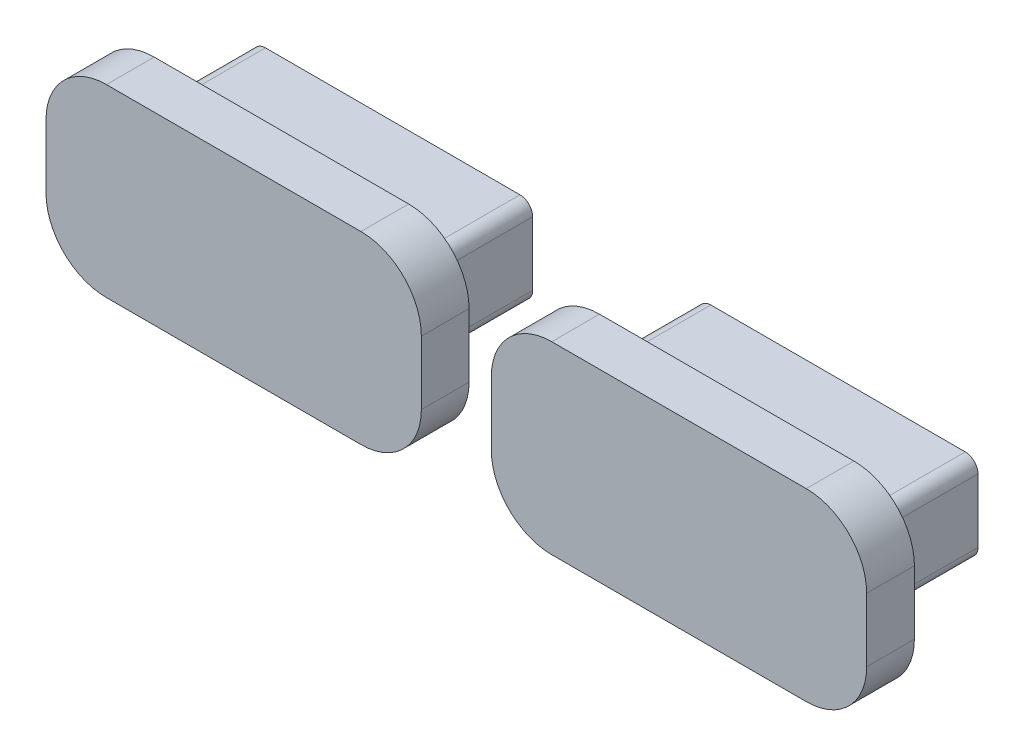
ISO-10303-21;
HEADER;
FILE_DESCRIPTION(('STEP AP214'),'2;1');
FILE_NAME('part.step','',(''),(''),'','','');
FILE_SCHEMA(('AUTOMOTIVE_DESIGN { 1 0 10303 214 1 1 1 1 }'));
ENDSEC;
DATA;
#1=APPLICATION_CONTEXT('core data for automotive mechanical design processes');
#2=APPLICATION_PROTOCOL_DEFINITION('international standard','automotive_design',2000,#1);
#3=PRODUCT_CONTEXT('',#1,'mechanical');
#4=PRODUCT('Part','Part','',(#3));
#5=PRODUCT_RELATED_PRODUCT_CATEGORY('part','',(#4));
#6=PRODUCT_DEFINITION_FORMATION('','',#4);
#7=PRODUCT_DEFINITION_CONTEXT('part definition',#1,'design');
#8=PRODUCT_DEFINITION('design','',#6,#7);
#9=PRODUCT_DEFINITION_SHAPE('','',#8);
#10=(LENGTH_UNIT() NAMED_UNIT(*) SI_UNIT(.MILLI.,.METRE.));
#11=(NAMED_UNIT(*) PLANE_ANGLE_UNIT() SI_UNIT($,.RADIAN.));
#12=(NAMED_UNIT(*) SI_UNIT($,.STERADIAN.) SOLID_ANGLE_UNIT());
#13=UNCERTAINTY_MEASURE_WITH_UNIT(LENGTH_MEASURE(1.E-05),#10,'distance_accuracy_value','');
#14=(GEOMETRIC_REPRESENTATION_CONTEXT(3) GLOBAL_UNCERTAINTY_ASSIGNED_CONTEXT((#13)) GLOBAL_UNIT_ASSIGNED_CONTEXT((#10,
#11,#12)) REPRESENTATION_CONTEXT('',''));
#15=CARTESIAN_POINT('',(0.,0.,0.));
#16=DIRECTION('',(0.,0.,1.));
#17=DIRECTION('',(1.,0.,0.));
#18=AXIS2_PLACEMENT_3D('',#15,#16,#17);
#19=CARTESIAN_POINT('',(34.2749999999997,-52.705,-18.078090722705));
#20=DIRECTION('',(0.,0.,1.));
#21=DIRECTION('',(1.,0.,0.));
#22=AXIS2_PLACEMENT_3D('',#19,#20,#21);
#23=CYLINDRICAL_SURFACE('',#22,0.508000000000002);
#24=CARTESIAN_POINT('',(34.2749999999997,-52.705,-6.35));
#25=DIRECTION('',(0.,0.,-1.));
#26=DIRECTION('',(-1.,0.,0.));
#27=AXIS2_PLACEMENT_3D('',#24,#25,#26);
#28=CIRCLE('',#27,0.508000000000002);
#29=CARTESIAN_POINT('',(34.2749999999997,-52.197,-6.35));
#30=VERTEX_POINT('',#29);
#31=CARTESIAN_POINT('',(34.7829999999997,-52.705,-6.35));
#32=VERTEX_POINT('',#31);
#33=EDGE_CURVE('E143',#30,#32,#28,.T.);
#34=ORIENTED_EDGE('',*,*,#33,.F.);
#35=DIRECTION('',(0.,0.,1.));
#36=VECTOR('',#35,1.);
#37=CARTESIAN_POINT('',(34.2749999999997,-52.197,-18.078090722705));
#38=LINE('',#37,#36);
#39=CARTESIAN_POINT('',(34.2749999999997,-52.197,-1.905));
#40=VERTEX_POINT('',#39);
#41=EDGE_CURVE('E48',#30,#40,#38,.T.);
#42=ORIENTED_EDGE('',*,*,#41,.T.);
#43=CARTESIAN_POINT('',(34.2749999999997,-52.705,-1.905));
#44=DIRECTION('',(0.,0.,-1.));
#45=DIRECTION('',(-1.,0.,0.));
#46=AXIS2_PLACEMENT_3D('',#43,#44,#45);
#47=CIRCLE('',#46,0.508000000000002);
#48=CARTESIAN_POINT('',(34.7829999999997,-52.705,-1.905));
#49=VERTEX_POINT('',#48);
#50=EDGE_CURVE('E151',#40,#49,#47,.T.);
#51=ORIENTED_EDGE('',*,*,#50,.T.);
#52=DIRECTION('',(0.,0.,1.));
#53=VECTOR('',#52,1.);
#54=CARTESIAN_POINT('',(34.7829999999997,-52.705,-18.078090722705));
#55=LINE('',#54,#53);
#56=EDGE_CURVE('E99',#32,#49,#55,.T.);
#57=ORIENTED_EDGE('',*,*,#56,.F.);
#58=EDGE_LOOP('',(#34,#42,#51,#57));
#59=FACE_BOUND('',#58,.T.);
#60=ADVANCED_FACE('F44',(#59),#23,.T.);
#61=CARTESIAN_POINT('',(34.7829999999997,-52.705,-18.078090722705));
#62=DIRECTION('',(-1.,0.,0.));
#63=DIRECTION('',(0.,0.,1.));
#64=AXIS2_PLACEMENT_3D('',#61,#62,#63);
#65=PLANE('',#64);
#66=DIRECTION('',(0.,-1.,0.));
#67=VECTOR('',#66,1.);
#68=CARTESIAN_POINT('',(34.7829999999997,-52.705,-6.35));
#69=LINE('',#68,#67);
#70=CARTESIAN_POINT('',(34.7829999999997,-55.245,-6.35));
#71=VERTEX_POINT('',#70);
#72=EDGE_CURVE('E106',#32,#71,#69,.T.);
#73=ORIENTED_EDGE('',*,*,#72,.F.);
#74=ORIENTED_EDGE('',*,*,#56,.T.);
#75=DIRECTION('',(0.,-1.,0.));
#76=VECTOR('',#75,1.);
#77=CARTESIAN_POINT('',(34.7829999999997,-52.705,-1.905));
#78=LINE('',#77,#76);
#79=CARTESIAN_POINT('',(34.7829999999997,-55.245,-1.905));
#80=VERTEX_POINT('',#79);
#81=EDGE_CURVE('E150',#49,#80,#78,.T.);
#82=ORIENTED_EDGE('',*,*,#81,.T.);
#83=DIRECTION('',(0.,0.,1.));
#84=VECTOR('',#83,1.);
#85=CARTESIAN_POINT('',(34.7829999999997,-55.245,-18.078090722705));
#86=LINE('',#85,#84);
#87=EDGE_CURVE('E152',#71,#80,#86,.T.);
#88=ORIENTED_EDGE('',*,*,#87,.F.);
#89=EDGE_LOOP('',(#73,#74,#82,#88));
#90=FACE_BOUND('',#89,.T.);
#91=ADVANCED_FACE('F181',(#90),#65,.F.);
#92=CARTESIAN_POINT('',(34.2749999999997,-55.245,-18.078090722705));
#93=DIRECTION('',(0.,0.,1.));
#94=DIRECTION('',(1.,0.,0.));
#95=AXIS2_PLACEMENT_3D('',#92,#93,#94);
#96=CYLINDRICAL_SURFACE('',#95,0.508000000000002);
#97=CARTESIAN_POINT('',(34.2749999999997,-55.245,-6.35));
#98=DIRECTION('',(0.,0.,-1.));
#99=DIRECTION('',(-1.,0.,0.));
#100=AXIS2_PLACEMENT_3D('',#97,#98,#99);
#101=CIRCLE('',#100,0.508000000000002);
#102=CARTESIAN_POINT('',(34.2749999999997,-55.753,-6.35));
#103=VERTEX_POINT('',#102);
#104=EDGE_CURVE('E139',#71,#103,#101,.T.);
#105=ORIENTED_EDGE('',*,*,#104,.F.);
#106=ORIENTED_EDGE('',*,*,#87,.T.);
#107=CARTESIAN_POINT('',(34.2749999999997,-55.245,-1.905));
#108=DIRECTION('',(0.,0.,-1.));
#109=DIRECTION('',(-1.,0.,0.));
#110=AXIS2_PLACEMENT_3D('',#107,#108,#109);
#111=CIRCLE('',#110,0.508000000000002);
#112=CARTESIAN_POINT('',(34.2749999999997,-55.753,-1.905));
#113=VERTEX_POINT('',#112);
#114=EDGE_CURVE('E154',#80,#113,#111,.T.);
#115=ORIENTED_EDGE('',*,*,#114,.T.);
#116=DIRECTION('',(0.,0.,1.));
#117=VECTOR('',#116,1.);
#118=CARTESIAN_POINT('',(34.2749999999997,-55.753,-18.078090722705));
#119=LINE('',#118,#117);
#120=EDGE_CURVE('E155',#103,#113,#119,.T.);
#121=ORIENTED_EDGE('',*,*,#120,.F.);
#122=EDGE_LOOP('',(#105,#106,#115,#121));
#123=FACE_BOUND('',#122,.T.);
#124=ADVANCED_FACE('F184',(#123),#96,.T.);
#125=CARTESIAN_POINT('',(34.2749999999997,-55.753,-18.078090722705));
#126=DIRECTION('',(0.,1.,0.));
#127=DIRECTION('',(0.,0.,1.));
#128=AXIS2_PLACEMENT_3D('',#125,#126,#127);
#129=PLANE('',#128);
#130=DIRECTION('',(-1.,0.,0.));
#131=VECTOR('',#130,1.);
#132=CARTESIAN_POINT('',(34.2749999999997,-55.753,-6.35));
#133=LINE('',#132,#131);
#134=CARTESIAN_POINT('',(24.1149999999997,-55.753,-6.35));
#135=VERTEX_POINT('',#134);
#136=EDGE_CURVE('E134',#103,#135,#133,.T.);
#137=ORIENTED_EDGE('',*,*,#136,.F.);
#138=ORIENTED_EDGE('',*,*,#120,.T.);
#139=DIRECTION('',(-1.,0.,0.));
#140=VECTOR('',#139,1.);
#141=CARTESIAN_POINT('',(34.2749999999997,-55.753,-1.905));
#142=LINE('',#141,#140);
#143=CARTESIAN_POINT('',(24.1149999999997,-55.753,-1.905));
#144=VERTEX_POINT('',#143);
#145=EDGE_CURVE('E157',#113,#144,#142,.T.);
#146=ORIENTED_EDGE('',*,*,#145,.T.);
#147=DIRECTION('',(0.,0.,1.));
#148=VECTOR('',#147,1.);
#149=CARTESIAN_POINT('',(24.1149999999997,-55.753,-18.078090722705));
#150=LINE('',#149,#148);
#151=EDGE_CURVE('E158',#135,#144,#150,.T.);
#152=ORIENTED_EDGE('',*,*,#151,.F.);
#153=EDGE_LOOP('',(#137,#138,#146,#152));
#154=FACE_BOUND('',#153,.T.);
#155=ADVANCED_FACE('F186',(#154),#129,.F.);
#156=CARTESIAN_POINT('',(24.1149999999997,-55.245,-18.078090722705));
#157=DIRECTION('',(0.,0.,1.));
#158=DIRECTION('',(1.,0.,0.));
#159=AXIS2_PLACEMENT_3D('',#156,#157,#158);
#160=CYLINDRICAL_SURFACE('',#159,0.508000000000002);
#161=CARTESIAN_POINT('',(24.1149999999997,-55.245,-6.35));
#162=DIRECTION('',(0.,0.,-1.));
#163=DIRECTION('',(-1.,0.,0.));
#164=AXIS2_PLACEMENT_3D('',#161,#162,#163);
#165=CIRCLE('',#164,0.508000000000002);
#166=CARTESIAN_POINT('',(23.6069999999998,-55.245,-6.35));
#167=VERTEX_POINT('',#166);
#168=EDGE_CURVE('E132',#135,#167,#165,.T.);
#169=ORIENTED_EDGE('',*,*,#168,.F.);
#170=ORIENTED_EDGE('',*,*,#151,.T.);
#171=CARTESIAN_POINT('',(24.1149999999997,-55.245,-1.905));
#172=DIRECTION('',(0.,0.,-1.));
#173=DIRECTION('',(-1.,0.,0.));
#174=AXIS2_PLACEMENT_3D('',#171,#172,#173);
#175=CIRCLE('',#174,0.508000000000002);
#176=CARTESIAN_POINT('',(23.6069999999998,-55.245,-1.905));
#177=VERTEX_POINT('',#176);
#178=EDGE_CURVE('E160',#144,#177,#175,.T.);
#179=ORIENTED_EDGE('',*,*,#178,.T.);
#180=DIRECTION('',(0.,0.,1.));
#181=VECTOR('',#180,1.);
#182=CARTESIAN_POINT('',(23.6069999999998,-55.245,-18.078090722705));
#183=LINE('',#182,#181);
#184=EDGE_CURVE('E161',#167,#177,#183,.T.);
#185=ORIENTED_EDGE('',*,*,#184,.F.);
#186=EDGE_LOOP('',(#169,#170,#179,#185));
#187=FACE_BOUND('',#186,.T.);
#188=ADVANCED_FACE('F190',(#187),#160,.T.);
#189=CARTESIAN_POINT('',(23.6069999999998,-55.245,-18.078090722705));
#190=DIRECTION('',(1.,0.,0.));
#191=DIRECTION('',(0.,0.,-1.));
#192=AXIS2_PLACEMENT_3D('',#189,#190,#191);
#193=PLANE('',#192);
#194=DIRECTION('',(0.,1.,0.));
#195=VECTOR('',#194,1.);
#196=CARTESIAN_POINT('',(23.6069999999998,-55.245,-6.35));
#197=LINE('',#196,#195);
#198=CARTESIAN_POINT('',(23.6069999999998,-52.705,-6.35));
#199=VERTEX_POINT('',#198);
#200=EDGE_CURVE('E53',#167,#199,#197,.T.);
#201=ORIENTED_EDGE('',*,*,#200,.F.);
#202=ORIENTED_EDGE('',*,*,#184,.T.);
#203=DIRECTION('',(0.,1.,0.));
#204=VECTOR('',#203,1.);
#205=CARTESIAN_POINT('',(23.6069999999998,-55.245,-1.905));
#206=LINE('',#205,#204);
#207=CARTESIAN_POINT('',(23.6069999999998,-52.705,-1.905));
#208=VERTEX_POINT('',#207);
#209=EDGE_CURVE('E126',#177,#208,#206,.T.);
#210=ORIENTED_EDGE('',*,*,#209,.T.);
#211=DIRECTION('',(0.,0.,1.));
#212=VECTOR('',#211,1.);
#213=CARTESIAN_POINT('',(23.6069999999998,-52.705,-18.078090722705));
#214=LINE('',#213,#212);
#215=EDGE_CURVE('E117',#199,#208,#214,.T.);
#216=ORIENTED_EDGE('',*,*,#215,.F.);
#217=EDGE_LOOP('',(#201,#202,#210,#216));
#218=FACE_BOUND('',#217,.T.);
#219=ADVANCED_FACE('F123',(#218),#193,.F.);
#220=CARTESIAN_POINT('',(24.1149999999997,-52.705,-18.078090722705));
#221=DIRECTION('',(0.,0.,1.));
#222=DIRECTION('',(1.,0.,0.));
#223=AXIS2_PLACEMENT_3D('',#220,#221,#222);
#224=CYLINDRICAL_SURFACE('',#223,0.508000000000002);
#225=CARTESIAN_POINT('',(24.1149999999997,-52.705,-6.35));
#226=DIRECTION('',(0.,0.,-1.));
#227=DIRECTION('',(-1.,0.,0.));
#228=AXIS2_PLACEMENT_3D('',#225,#226,#227);
#229=CIRCLE('',#228,0.508000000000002);
#230=CARTESIAN_POINT('',(24.1149999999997,-52.197,-6.35));
#231=VERTEX_POINT('',#230);
#232=EDGE_CURVE('E12',#199,#231,#229,.T.);
#233=ORIENTED_EDGE('',*,*,#232,.F.);
#234=ORIENTED_EDGE('',*,*,#215,.T.);
#235=CARTESIAN_POINT('',(24.1149999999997,-52.705,-1.905));
#236=DIRECTION('',(0.,0.,-1.));
#237=DIRECTION('',(-1.,0.,0.));
#238=AXIS2_PLACEMENT_3D('',#235,#236,#237);
#239=CIRCLE('',#238,0.508000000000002);
#240=CARTESIAN_POINT('',(24.1149999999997,-52.197,-1.905));
#241=VERTEX_POINT('',#240);
#242=EDGE_CURVE('E128',#208,#241,#239,.T.);
#243=ORIENTED_EDGE('',*,*,#242,.T.);
#244=DIRECTION('',(0.,0.,1.));
#245=VECTOR('',#244,1.);
#246=CARTESIAN_POINT('',(24.1149999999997,-52.197,-18.078090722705));
#247=LINE('',#246,#245);
#248=EDGE_CURVE('E66',#231,#241,#247,.T.);
#249=ORIENTED_EDGE('',*,*,#248,.F.);
#250=EDGE_LOOP('',(#233,#234,#243,#249));
#251=FACE_BOUND('',#250,.T.);
#252=ADVANCED_FACE('F116',(#251),#224,.T.);
#253=CARTESIAN_POINT('',(24.1149999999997,-52.197,-18.078090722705));
#254=DIRECTION('',(0.,-1.,0.));
#255=DIRECTION('',(0.,0.,-1.));
#256=AXIS2_PLACEMENT_3D('',#253,#254,#255);
#257=PLANE('',#256);
#258=DIRECTION('',(1.,0.,0.));
#259=VECTOR('',#258,1.);
#260=CARTESIAN_POINT('',(24.1149999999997,-52.197,-6.35));
#261=LINE('',#260,#259);
#262=EDGE_CURVE('E146',#231,#30,#261,.T.);
#263=ORIENTED_EDGE('',*,*,#262,.F.);
#264=ORIENTED_EDGE('',*,*,#248,.T.);
#265=DIRECTION('',(1.,0.,0.));
#266=VECTOR('',#265,1.);
#267=CARTESIAN_POINT('',(24.1149999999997,-52.197,-1.905));
#268=LINE('',#267,#266);
#269=EDGE_CURVE('E148',#241,#40,#268,.T.);
#270=ORIENTED_EDGE('',*,*,#269,.T.);
#271=ORIENTED_EDGE('',*,*,#41,.F.);
#272=EDGE_LOOP('',(#263,#264,#270,#271));
#273=FACE_BOUND('',#272,.T.);
#274=ADVANCED_FACE('F176',(#273),#257,.F.);
#275=CARTESIAN_POINT('',(34.2749999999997,-52.705,-1.905));
#276=DIRECTION('',(0.,0.,-1.));
#277=DIRECTION('',(-1.,0.,0.));
#278=AXIS2_PLACEMENT_3D('',#275,#276,#277);
#279=PLANE('',#278);
#280=ORIENTED_EDGE('',*,*,#50,.F.);
#281=ORIENTED_EDGE('',*,*,#269,.F.);
#282=ORIENTED_EDGE('',*,*,#242,.F.);
#283=ORIENTED_EDGE('',*,*,#209,.F.);
#284=ORIENTED_EDGE('',*,*,#178,.F.);
#285=ORIENTED_EDGE('',*,*,#145,.F.);
#286=ORIENTED_EDGE('',*,*,#114,.F.);
#287=ORIENTED_EDGE('',*,*,#81,.F.);
#288=EDGE_LOOP('',(#280,#281,#282,#283,#284,#285,#286,#287));
#289=FACE_BOUND('',#288,.T.);
#290=ADVANCED_FACE('F178',(#289),#279,.F.);
#291=CARTESIAN_POINT('',(-36.785,-36.195,-6.35));
#292=DIRECTION('',(0.,0.,-1.));
#293=DIRECTION('',(-1.,0.,0.));
#294=AXIS2_PLACEMENT_3D('',#291,#292,#293);
#295=PLANE('',#294);
#296=ORIENTED_EDGE('',*,*,#262,.T.);
#297=ORIENTED_EDGE('',*,*,#33,.T.);
#298=ORIENTED_EDGE('',*,*,#72,.T.);
#299=ORIENTED_EDGE('',*,*,#104,.T.);
#300=ORIENTED_EDGE('',*,*,#136,.T.);
#301=ORIENTED_EDGE('',*,*,#168,.T.);
#302=ORIENTED_EDGE('',*,*,#200,.T.);
#303=ORIENTED_EDGE('',*,*,#232,.T.);
#304=EDGE_LOOP('',(#296,#297,#298,#299,#300,#301,#302,#303));
#305=FACE_BOUND('',#304,.T.);
#306=ADVANCED_FACE('F46',(#305),#295,.T.);
#307=CLOSED_SHELL('',(#60,#91,#124,#155,#188,#219,#252,#274,#290,#306));
#308=MANIFOLD_SOLID_BREP('B2',#307);
#309=CARTESIAN_POINT('',(6.33499999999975,-55.245,-18.078090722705));
#310=DIRECTION('',(0.,0.,1.));
#311=DIRECTION('',(1.,0.,0.));
#312=AXIS2_PLACEMENT_3D('',#309,#310,#311);
#313=CYLINDRICAL_SURFACE('',#312,0.508000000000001);
#314=CARTESIAN_POINT('',(6.33499999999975,-55.245,-6.35));
#315=DIRECTION('',(0.,0.,-1.));
#316=DIRECTION('',(-1.,0.,0.));
#317=AXIS2_PLACEMENT_3D('',#314,#315,#316);
#318=CIRCLE('',#317,0.508000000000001);
#319=CARTESIAN_POINT('',(6.33499999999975,-55.753,-6.35));
#320=VERTEX_POINT('',#319);
#321=CARTESIAN_POINT('',(5.82699999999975,-55.245,-6.35));
#322=VERTEX_POINT('',#321);
#323=EDGE_CURVE('E381',#320,#322,#318,.T.);
#324=ORIENTED_EDGE('',*,*,#323,.F.);
#325=DIRECTION('',(0.,0.,1.));
#326=VECTOR('',#325,1.);
#327=CARTESIAN_POINT('',(6.33499999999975,-55.753,-18.078090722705));
#328=LINE('',#327,#326);
#329=CARTESIAN_POINT('',(6.33499999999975,-55.753,-1.905));
#330=VERTEX_POINT('',#329);
#331=EDGE_CURVE('E286',#320,#330,#328,.T.);
#332=ORIENTED_EDGE('',*,*,#331,.T.);
#333=CARTESIAN_POINT('',(6.33499999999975,-55.245,-1.905));
#334=DIRECTION('',(0.,0.,-1.));
#335=DIRECTION('',(-1.,0.,0.));
#336=AXIS2_PLACEMENT_3D('',#333,#334,#335);
#337=CIRCLE('',#336,0.508000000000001);
#338=CARTESIAN_POINT('',(5.82699999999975,-55.245,-1.905));
#339=VERTEX_POINT('',#338);
#340=EDGE_CURVE('E389',#330,#339,#337,.T.);
#341=ORIENTED_EDGE('',*,*,#340,.T.);
#342=DIRECTION('',(0.,0.,1.));
#343=VECTOR('',#342,1.);
#344=CARTESIAN_POINT('',(5.82699999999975,-55.245,-18.078090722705));
#345=LINE('',#344,#343);
#346=EDGE_CURVE('E337',#322,#339,#345,.T.);
#347=ORIENTED_EDGE('',*,*,#346,.F.);
#348=EDGE_LOOP('',(#324,#332,#341,#347));
#349=FACE_BOUND('',#348,.T.);
#350=ADVANCED_FACE('F282',(#349),#313,.T.);
#351=CARTESIAN_POINT('',(5.82699999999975,-55.245,-18.078090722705));
#352=DIRECTION('',(1.,0.,0.));
#353=DIRECTION('',(0.,0.,-1.));
#354=AXIS2_PLACEMENT_3D('',#351,#352,#353);
#355=PLANE('',#354);
#356=DIRECTION('',(0.,1.,0.));
#357=VECTOR('',#356,1.);
#358=CARTESIAN_POINT('',(5.82699999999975,-55.245,-6.35));
#359=LINE('',#358,#357);
#360=CARTESIAN_POINT('',(5.82699999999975,-52.705,-6.35));
#361=VERTEX_POINT('',#360);
#362=EDGE_CURVE('E344',#322,#361,#359,.T.);
#363=ORIENTED_EDGE('',*,*,#362,.F.);
#364=ORIENTED_EDGE('',*,*,#346,.T.);
#365=DIRECTION('',(0.,1.,0.));
#366=VECTOR('',#365,1.);
#367=CARTESIAN_POINT('',(5.82699999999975,-55.245,-1.905));
#368=LINE('',#367,#366);
#369=CARTESIAN_POINT('',(5.82699999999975,-52.705,-1.905));
#370=VERTEX_POINT('',#369);
#371=EDGE_CURVE('E388',#339,#370,#368,.T.);
#372=ORIENTED_EDGE('',*,*,#371,.T.);
#373=DIRECTION('',(0.,0.,1.));
#374=VECTOR('',#373,1.);
#375=CARTESIAN_POINT('',(5.82699999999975,-52.705,-18.078090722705));
#376=LINE('',#375,#374);
#377=EDGE_CURVE('E390',#361,#370,#376,.T.);
#378=ORIENTED_EDGE('',*,*,#377,.F.);
#379=EDGE_LOOP('',(#363,#364,#372,#378));
#380=FACE_BOUND('',#379,.T.);
#381=ADVANCED_FACE('F419',(#380),#355,.F.);
#382=CARTESIAN_POINT('',(6.33499999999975,-52.705,-18.078090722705));
#383=DIRECTION('',(0.,0.,1.));
#384=DIRECTION('',(1.,0.,0.));
#385=AXIS2_PLACEMENT_3D('',#382,#383,#384);
#386=CYLINDRICAL_SURFACE('',#385,0.508000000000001);
#387=CARTESIAN_POINT('',(6.33499999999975,-52.705,-6.35));
#388=DIRECTION('',(0.,0.,-1.));
#389=DIRECTION('',(-1.,0.,0.));
#390=AXIS2_PLACEMENT_3D('',#387,#388,#389);
#391=CIRCLE('',#390,0.508000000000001);
#392=CARTESIAN_POINT('',(6.33499999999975,-52.197,-6.35));
#393=VERTEX_POINT('',#392);
#394=EDGE_CURVE('E377',#361,#393,#391,.T.);
#395=ORIENTED_EDGE('',*,*,#394,.F.);
#396=ORIENTED_EDGE('',*,*,#377,.T.);
#397=CARTESIAN_POINT('',(6.33499999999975,-52.705,-1.905));
#398=DIRECTION('',(0.,0.,-1.));
#399=DIRECTION('',(-1.,0.,0.));
#400=AXIS2_PLACEMENT_3D('',#397,#398,#399);
#401=CIRCLE('',#400,0.508000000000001);
#402=CARTESIAN_POINT('',(6.33499999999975,-52.197,-1.905));
#403=VERTEX_POINT('',#402);
#404=EDGE_CURVE('E392',#370,#403,#401,.T.);
#405=ORIENTED_EDGE('',*,*,#404,.T.);
#406=DIRECTION('',(0.,0.,1.));
#407=VECTOR('',#406,1.);
#408=CARTESIAN_POINT('',(6.33499999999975,-52.197,-18.078090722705));
#409=LINE('',#408,#407);
#410=EDGE_CURVE('E393',#393,#403,#409,.T.);
#411=ORIENTED_EDGE('',*,*,#410,.F.);
#412=EDGE_LOOP('',(#395,#396,#405,#411));
#413=FACE_BOUND('',#412,.T.);
#414=ADVANCED_FACE('F422',(#413),#386,.T.);
#415=CARTESIAN_POINT('',(6.33499999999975,-52.197,-18.078090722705));
#416=DIRECTION('',(0.,-1.,0.));
#417=DIRECTION('',(0.,0.,-1.));
#418=AXIS2_PLACEMENT_3D('',#415,#416,#417);
#419=PLANE('',#418);
#420=DIRECTION('',(1.,0.,0.));
#421=VECTOR('',#420,1.);
#422=CARTESIAN_POINT('',(6.33499999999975,-52.197,-6.35));
#423=LINE('',#422,#421);
#424=CARTESIAN_POINT('',(16.4949999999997,-52.197,-6.35));
#425=VERTEX_POINT('',#424);
#426=EDGE_CURVE('E372',#393,#425,#423,.T.);
#427=ORIENTED_EDGE('',*,*,#426,.F.);
#428=ORIENTED_EDGE('',*,*,#410,.T.);
#429=DIRECTION('',(1.,0.,0.));
#430=VECTOR('',#429,1.);
#431=CARTESIAN_POINT('',(6.33499999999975,-52.197,-1.905));
#432=LINE('',#431,#430);
#433=CARTESIAN_POINT('',(16.4949999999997,-52.197,-1.905));
#434=VERTEX_POINT('',#433);
#435=EDGE_CURVE('E395',#403,#434,#432,.T.);
#436=ORIENTED_EDGE('',*,*,#435,.T.);
#437=DIRECTION('',(0.,0.,1.));
#438=VECTOR('',#437,1.);
#439=CARTESIAN_POINT('',(16.4949999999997,-52.197,-18.078090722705));
#440=LINE('',#439,#438);
#441=EDGE_CURVE('E396',#425,#434,#440,.T.);
#442=ORIENTED_EDGE('',*,*,#441,.F.);
#443=EDGE_LOOP('',(#427,#428,#436,#442));
#444=FACE_BOUND('',#443,.T.);
#445=ADVANCED_FACE('F424',(#444),#419,.F.);
#446=CARTESIAN_POINT('',(16.4949999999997,-52.705,-18.078090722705));
#447=DIRECTION('',(0.,0.,1.));
#448=DIRECTION('',(1.,0.,0.));
#449=AXIS2_PLACEMENT_3D('',#446,#447,#448);
#450=CYLINDRICAL_SURFACE('',#449,0.508000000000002);
#451=CARTESIAN_POINT('',(16.4949999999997,-52.705,-6.35));
#452=DIRECTION('',(0.,0.,-1.));
#453=DIRECTION('',(-1.,0.,0.));
#454=AXIS2_PLACEMENT_3D('',#451,#452,#453);
#455=CIRCLE('',#454,0.508000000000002);
#456=CARTESIAN_POINT('',(17.0029999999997,-52.705,-6.35));
#457=VERTEX_POINT('',#456);
#458=EDGE_CURVE('E370',#425,#457,#455,.T.);
#459=ORIENTED_EDGE('',*,*,#458,.F.);
#460=ORIENTED_EDGE('',*,*,#441,.T.);
#461=CARTESIAN_POINT('',(16.4949999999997,-52.705,-1.905));
#462=DIRECTION('',(0.,0.,-1.));
#463=DIRECTION('',(-1.,0.,0.));
#464=AXIS2_PLACEMENT_3D('',#461,#462,#463);
#465=CIRCLE('',#464,0.508000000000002);
#466=CARTESIAN_POINT('',(17.0029999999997,-52.705,-1.905));
#467=VERTEX_POINT('',#466);
#468=EDGE_CURVE('E398',#434,#467,#465,.T.);
#469=ORIENTED_EDGE('',*,*,#468,.T.);
#470=DIRECTION('',(0.,0.,1.));
#471=VECTOR('',#470,1.);
#472=CARTESIAN_POINT('',(17.0029999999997,-52.705,-18.078090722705));
#473=LINE('',#472,#471);
#474=EDGE_CURVE('E399',#457,#467,#473,.T.);
#475=ORIENTED_EDGE('',*,*,#474,.F.);
#476=EDGE_LOOP('',(#459,#460,#469,#475));
#477=FACE_BOUND('',#476,.T.);
#478=ADVANCED_FACE('F428',(#477),#450,.T.);
#479=CARTESIAN_POINT('',(17.0029999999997,-52.705,-18.078090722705));
#480=DIRECTION('',(-1.,0.,0.));
#481=DIRECTION('',(0.,0.,1.));
#482=AXIS2_PLACEMENT_3D('',#479,#480,#481);
#483=PLANE('',#482);
#484=DIRECTION('',(0.,-1.,0.));
#485=VECTOR('',#484,1.);
#486=CARTESIAN_POINT('',(17.0029999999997,-52.705,-6.35));
#487=LINE('',#486,#485);
#488=CARTESIAN_POINT('',(17.0029999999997,-55.245,-6.35));
#489=VERTEX_POINT('',#488);
#490=EDGE_CURVE('E291',#457,#489,#487,.T.);
#491=ORIENTED_EDGE('',*,*,#490,.F.);
#492=ORIENTED_EDGE('',*,*,#474,.T.);
#493=DIRECTION('',(0.,-1.,0.));
#494=VECTOR('',#493,1.);
#495=CARTESIAN_POINT('',(17.0029999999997,-52.705,-1.905));
#496=LINE('',#495,#494);
#497=CARTESIAN_POINT('',(17.0029999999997,-55.245,-1.905));
#498=VERTEX_POINT('',#497);
#499=EDGE_CURVE('E364',#467,#498,#496,.T.);
#500=ORIENTED_EDGE('',*,*,#499,.T.);
#501=DIRECTION('',(0.,0.,1.));
#502=VECTOR('',#501,1.);
#503=CARTESIAN_POINT('',(17.0029999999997,-55.245,-18.078090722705));
#504=LINE('',#503,#502);
#505=EDGE_CURVE('E355',#489,#498,#504,.T.);
#506=ORIENTED_EDGE('',*,*,#505,.F.);
#507=EDGE_LOOP('',(#491,#492,#500,#506));
#508=FACE_BOUND('',#507,.T.);
#509=ADVANCED_FACE('F361',(#508),#483,.F.);
#510=CARTESIAN_POINT('',(16.4949999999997,-55.245,-18.078090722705));
#511=DIRECTION('',(0.,0.,1.));
#512=DIRECTION('',(1.,0.,0.));
#513=AXIS2_PLACEMENT_3D('',#510,#511,#512);
#514=CYLINDRICAL_SURFACE('',#513,0.508000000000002);
#515=CARTESIAN_POINT('',(16.4949999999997,-55.245,-6.35));
#516=DIRECTION('',(0.,0.,-1.));
#517=DIRECTION('',(-1.,0.,0.));
#518=AXIS2_PLACEMENT_3D('',#515,#516,#517);
#519=CIRCLE('',#518,0.508000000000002);
#520=CARTESIAN_POINT('',(16.4949999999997,-55.753,-6.35));
#521=VERTEX_POINT('',#520);
#522=EDGE_CURVE('E42',#489,#521,#519,.T.);
#523=ORIENTED_EDGE('',*,*,#522,.F.);
#524=ORIENTED_EDGE('',*,*,#505,.T.);
#525=CARTESIAN_POINT('',(16.4949999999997,-55.245,-1.905));
#526=DIRECTION('',(0.,0.,-1.));
#527=DIRECTION('',(-1.,0.,0.));
#528=AXIS2_PLACEMENT_3D('',#525,#526,#527);
#529=CIRCLE('',#528,0.508000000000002);
#530=CARTESIAN_POINT('',(16.4949999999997,-55.753,-1.905));
#531=VERTEX_POINT('',#530);
#532=EDGE_CURVE('E366',#498,#531,#529,.T.);
#533=ORIENTED_EDGE('',*,*,#532,.T.);
#534=DIRECTION('',(0.,0.,1.));
#535=VECTOR('',#534,1.);
#536=CARTESIAN_POINT('',(16.4949999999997,-55.753,-18.078090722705));
#537=LINE('',#536,#535);
#538=EDGE_CURVE('E304',#521,#531,#537,.T.);
#539=ORIENTED_EDGE('',*,*,#538,.F.);
#540=EDGE_LOOP('',(#523,#524,#533,#539));
#541=FACE_BOUND('',#540,.T.);
#542=ADVANCED_FACE('F354',(#541),#514,.T.);
#543=CARTESIAN_POINT('',(16.4949999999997,-55.753,-18.078090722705));
#544=DIRECTION('',(0.,1.,0.));
#545=DIRECTION('',(0.,0.,1.));
#546=AXIS2_PLACEMENT_3D('',#543,#544,#545);
#547=PLANE('',#546);
#548=DIRECTION('',(-1.,0.,0.));
#549=VECTOR('',#548,1.);
#550=CARTESIAN_POINT('',(16.4949999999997,-55.753,-6.35));
#551=LINE('',#550,#549);
#552=EDGE_CURVE('E384',#521,#320,#551,.T.);
#553=ORIENTED_EDGE('',*,*,#552,.F.);
#554=ORIENTED_EDGE('',*,*,#538,.T.);
#555=DIRECTION('',(-1.,0.,0.));
#556=VECTOR('',#555,1.);
#557=CARTESIAN_POINT('',(16.4949999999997,-55.753,-1.905));
#558=LINE('',#557,#556);
#559=EDGE_CURVE('E386',#531,#330,#558,.T.);
#560=ORIENTED_EDGE('',*,*,#559,.T.);
#561=ORIENTED_EDGE('',*,*,#331,.F.);
#562=EDGE_LOOP('',(#553,#554,#560,#561));
#563=FACE_BOUND('',#562,.T.);
#564=ADVANCED_FACE('F414',(#563),#547,.F.);
#565=CARTESIAN_POINT('',(6.33499999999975,-55.245,-1.905));
#566=DIRECTION('',(0.,0.,-1.));
#567=DIRECTION('',(-1.,0.,0.));
#568=AXIS2_PLACEMENT_3D('',#565,#566,#567);
#569=PLANE('',#568);
#570=ORIENTED_EDGE('',*,*,#340,.F.);
#571=ORIENTED_EDGE('',*,*,#559,.F.);
#572=ORIENTED_EDGE('',*,*,#532,.F.);
#573=ORIENTED_EDGE('',*,*,#499,.F.);
#574=ORIENTED_EDGE('',*,*,#468,.F.);
#575=ORIENTED_EDGE('',*,*,#435,.F.);
#576=ORIENTED_EDGE('',*,*,#404,.F.);
#577=ORIENTED_EDGE('',*,*,#371,.F.);
#578=EDGE_LOOP('',(#570,#571,#572,#573,#574,#575,#576,#577));
#579=FACE_BOUND('',#578,.T.);
#580=ADVANCED_FACE('F416',(#579),#569,.F.);
#581=CARTESIAN_POINT('',(-36.785,-36.195,-6.35));
#582=DIRECTION('',(0.,0.,-1.));
#583=DIRECTION('',(-1.,0.,0.));
#584=AXIS2_PLACEMENT_3D('',#581,#582,#583);
#585=PLANE('',#584);
#586=ORIENTED_EDGE('',*,*,#552,.T.);
#587=ORIENTED_EDGE('',*,*,#323,.T.);
#588=ORIENTED_EDGE('',*,*,#362,.T.);
#589=ORIENTED_EDGE('',*,*,#394,.T.);
#590=ORIENTED_EDGE('',*,*,#426,.T.);
#591=ORIENTED_EDGE('',*,*,#458,.T.);
#592=ORIENTED_EDGE('',*,*,#490,.T.);
#593=ORIENTED_EDGE('',*,*,#522,.T.);
#594=EDGE_LOOP('',(#586,#587,#588,#589,#590,#591,#592,#593));
#595=FACE_BOUND('',#594,.T.);
#596=ADVANCED_FACE('F284',(#595),#585,.T.);
#597=CLOSED_SHELL('',(#350,#381,#414,#445,#478,#509,#542,#564,#580,#596));
#598=MANIFOLD_SOLID_BREP('B6',#597);
#599=CARTESIAN_POINT('',(24.1149999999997,-55.245,-18.6034475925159));
#600=DIRECTION('',(0.,0.,1.));
#601=DIRECTION('',(1.,0.,0.));
#602=AXIS2_PLACEMENT_3D('',#599,#600,#601);
#603=CYLINDRICAL_SURFACE('',#602,2.413);
#604=CARTESIAN_POINT('',(24.1149999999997,-55.245,-1.905));
#605=DIRECTION('',(0.,0.,1.));
#606=DIRECTION('',(1.,0.,0.));
#607=AXIS2_PLACEMENT_3D('',#604,#605,#606);
#608=CIRCLE('',#607,2.413);
#609=CARTESIAN_POINT('',(24.1149999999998,-57.658,-1.905));
#610=VERTEX_POINT('',#609);
#611=CARTESIAN_POINT('',(21.7019999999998,-55.245,-1.905));
#612=VERTEX_POINT('',#611);
#613=EDGE_CURVE('E527',#610,#612,#608,.F.);
#614=ORIENTED_EDGE('',*,*,#613,.F.);
#615=DIRECTION('',(0.,0.,1.));
#616=VECTOR('',#615,1.);
#617=CARTESIAN_POINT('',(24.1149999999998,-57.658,-18.6034475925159));
#618=LINE('',#617,#616);
#619=CARTESIAN_POINT('',(24.1149999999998,-57.658,0.));
#620=VERTEX_POINT('',#619);
#621=EDGE_CURVE('E585',#610,#620,#618,.T.);
#622=ORIENTED_EDGE('',*,*,#621,.T.);
#623=CARTESIAN_POINT('',(24.1149999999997,-55.245,0.));
#624=DIRECTION('',(0.,0.,1.));
#625=DIRECTION('',(1.,0.,0.));
#626=AXIS2_PLACEMENT_3D('',#623,#624,#625);
#627=CIRCLE('',#626,2.413);
#628=CARTESIAN_POINT('',(21.7019999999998,-55.245,0.));
#629=VERTEX_POINT('',#628);
#630=EDGE_CURVE('E588',#629,#620,#627,.T.);
#631=ORIENTED_EDGE('',*,*,#630,.F.);
#632=DIRECTION('',(0.,0.,1.));
#633=VECTOR('',#632,1.);
#634=CARTESIAN_POINT('',(21.7019999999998,-55.245,-18.6034475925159));
#635=LINE('',#634,#633);
#636=EDGE_CURVE('E561',#612,#629,#635,.T.);
#637=ORIENTED_EDGE('',*,*,#636,.F.);
#638=EDGE_LOOP('',(#614,#622,#631,#637));
#639=FACE_BOUND('',#638,.T.);
#640=ADVANCED_FACE('F519',(#639),#603,.T.);
#641=CARTESIAN_POINT('',(21.7019999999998,-52.705,-18.6034475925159));
#642=DIRECTION('',(-1.,0.,0.));
#643=DIRECTION('',(0.,0.,1.));
#644=AXIS2_PLACEMENT_3D('',#641,#642,#643);
#645=PLANE('',#644);
#646=DIRECTION('',(0.,1.,0.));
#647=VECTOR('',#646,1.);
#648=CARTESIAN_POINT('',(21.7019999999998,-52.705,-1.905));
#649=LINE('',#648,#647);
#650=CARTESIAN_POINT('',(21.7019999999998,-52.705,-1.905));
#651=VERTEX_POINT('',#650);
#652=EDGE_CURVE('E657',#612,#651,#649,.T.);
#653=ORIENTED_EDGE('',*,*,#652,.F.);
#654=ORIENTED_EDGE('',*,*,#636,.T.);
#655=DIRECTION('',(0.,-1.,0.));
#656=VECTOR('',#655,1.);
#657=CARTESIAN_POINT('',(21.7019999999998,-52.705,0.));
#658=LINE('',#657,#656);
#659=CARTESIAN_POINT('',(21.7019999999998,-52.705,0.));
#660=VERTEX_POINT('',#659);
#661=EDGE_CURVE('E592',#660,#629,#658,.T.);
#662=ORIENTED_EDGE('',*,*,#661,.F.);
#663=DIRECTION('',(0.,0.,1.));
#664=VECTOR('',#663,1.);
#665=CARTESIAN_POINT('',(21.7019999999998,-52.705,-18.6034475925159));
#666=LINE('',#665,#664);
#667=EDGE_CURVE('E621',#651,#660,#666,.T.);
#668=ORIENTED_EDGE('',*,*,#667,.F.);
#669=EDGE_LOOP('',(#653,#654,#662,#668));
#670=FACE_BOUND('',#669,.T.);
#671=ADVANCED_FACE('F656',(#670),#645,.T.);
#672=CARTESIAN_POINT('',(24.1149999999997,-52.705,-18.6034475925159));
#673=DIRECTION('',(0.,0.,1.));
#674=DIRECTION('',(1.,0.,0.));
#675=AXIS2_PLACEMENT_3D('',#672,#673,#674);
#676=CYLINDRICAL_SURFACE('',#675,2.413);
#677=CARTESIAN_POINT('',(24.1149999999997,-52.705,-1.905));
#678=DIRECTION('',(0.,0.,1.));
#679=DIRECTION('',(1.,0.,0.));
#680=AXIS2_PLACEMENT_3D('',#677,#678,#679);
#681=CIRCLE('',#680,2.413);
#682=CARTESIAN_POINT('',(24.1149999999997,-50.292,-1.905));
#683=VERTEX_POINT('',#682);
#684=EDGE_CURVE('E658',#651,#683,#681,.F.);
#685=ORIENTED_EDGE('',*,*,#684,.F.);
#686=ORIENTED_EDGE('',*,*,#667,.T.);
#687=CARTESIAN_POINT('',(24.1149999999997,-52.705,0.));
#688=DIRECTION('',(0.,0.,1.));
#689=DIRECTION('',(1.,0.,0.));
#690=AXIS2_PLACEMENT_3D('',#687,#688,#689);
#691=CIRCLE('',#690,2.413);
#692=CARTESIAN_POINT('',(24.1149999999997,-50.292,0.));
#693=VERTEX_POINT('',#692);
#694=EDGE_CURVE('E617',#693,#660,#691,.T.);
#695=ORIENTED_EDGE('',*,*,#694,.F.);
#696=DIRECTION('',(0.,0.,1.));
#697=VECTOR('',#696,1.);
#698=CARTESIAN_POINT('',(24.1149999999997,-50.292,-18.6034475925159));
#699=LINE('',#698,#697);
#700=EDGE_CURVE('E623',#683,#693,#699,.T.);
#701=ORIENTED_EDGE('',*,*,#700,.F.);
#702=EDGE_LOOP('',(#685,#686,#695,#701));
#703=FACE_BOUND('',#702,.T.);
#704=ADVANCED_FACE('F654',(#703),#676,.T.);
#705=CARTESIAN_POINT('',(34.2749999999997,-50.292,-18.6034475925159));
#706=DIRECTION('',(0.,1.,0.));
#707=DIRECTION('',(0.,0.,1.));
#708=AXIS2_PLACEMENT_3D('',#705,#706,#707);
#709=PLANE('',#708);
#710=DIRECTION('',(1.,0.,0.));
#711=VECTOR('',#710,1.);
#712=CARTESIAN_POINT('',(34.2749999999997,-50.292,-1.905));
#713=LINE('',#712,#711);
#714=CARTESIAN_POINT('',(34.2749999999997,-50.292,-1.905));
#715=VERTEX_POINT('',#714);
#716=EDGE_CURVE('E651',#683,#715,#713,.T.);
#717=ORIENTED_EDGE('',*,*,#716,.F.);
#718=ORIENTED_EDGE('',*,*,#700,.T.);
#719=DIRECTION('',(-1.,0.,0.));
#720=VECTOR('',#719,1.);
#721=CARTESIAN_POINT('',(34.2749999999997,-50.292,0.));
#722=LINE('',#721,#720);
#723=CARTESIAN_POINT('',(34.2749999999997,-50.292,0.));
#724=VERTEX_POINT('',#723);
#725=EDGE_CURVE('E614',#724,#693,#722,.T.);
#726=ORIENTED_EDGE('',*,*,#725,.F.);
#727=DIRECTION('',(0.,0.,1.));
#728=VECTOR('',#727,1.);
#729=CARTESIAN_POINT('',(34.2749999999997,-50.292,-18.6034475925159));
#730=LINE('',#729,#728);
#731=EDGE_CURVE('E625',#715,#724,#730,.T.);
#732=ORIENTED_EDGE('',*,*,#731,.F.);
#733=EDGE_LOOP('',(#717,#718,#726,#732));
#734=FACE_BOUND('',#733,.T.);
#735=ADVANCED_FACE('F648',(#734),#709,.T.);
#736=CARTESIAN_POINT('',(34.2749999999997,-52.705,-18.6034475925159));
#737=DIRECTION('',(0.,0.,1.));
#738=DIRECTION('',(1.,0.,0.));
#739=AXIS2_PLACEMENT_3D('',#736,#737,#738);
#740=CYLINDRICAL_SURFACE('',#739,2.413);
#741=CARTESIAN_POINT('',(34.2749999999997,-52.705,-1.905));
#742=DIRECTION('',(0.,0.,1.));
#743=DIRECTION('',(1.,0.,0.));
#744=AXIS2_PLACEMENT_3D('',#741,#742,#743);
#745=CIRCLE('',#744,2.413);
#746=CARTESIAN_POINT('',(36.6879999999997,-52.705,-1.905));
#747=VERTEX_POINT('',#746);
#748=EDGE_CURVE('E645',#715,#747,#745,.F.);
#749=ORIENTED_EDGE('',*,*,#748,.F.);
#750=ORIENTED_EDGE('',*,*,#731,.T.);
#751=CARTESIAN_POINT('',(34.2749999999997,-52.705,0.));
#752=DIRECTION('',(0.,0.,1.));
#753=DIRECTION('',(1.,0.,0.));
#754=AXIS2_PLACEMENT_3D('',#751,#752,#753);
#755=CIRCLE('',#754,2.413);
#756=CARTESIAN_POINT('',(36.6879999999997,-52.705,0.));
#757=VERTEX_POINT('',#756);
#758=EDGE_CURVE('E611',#757,#724,#755,.T.);
#759=ORIENTED_EDGE('',*,*,#758,.F.);
#760=DIRECTION('',(0.,0.,1.));
#761=VECTOR('',#760,1.);
#762=CARTESIAN_POINT('',(36.6879999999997,-52.705,-18.6034475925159));
#763=LINE('',#762,#761);
#764=EDGE_CURVE('E627',#747,#757,#763,.T.);
#765=ORIENTED_EDGE('',*,*,#764,.F.);
#766=EDGE_LOOP('',(#749,#750,#759,#765));
#767=FACE_BOUND('',#766,.T.);
#768=ADVANCED_FACE('F643',(#767),#740,.T.);
#769=CARTESIAN_POINT('',(36.6879999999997,-55.245,-18.6034475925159));
#770=DIRECTION('',(1.,0.,0.));
#771=DIRECTION('',(0.,0.,-1.));
#772=AXIS2_PLACEMENT_3D('',#769,#770,#771);
#773=PLANE('',#772);
#774=DIRECTION('',(0.,-1.,0.));
#775=VECTOR('',#774,1.);
#776=CARTESIAN_POINT('',(36.6879999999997,-55.245,-1.905));
#777=LINE('',#776,#775);
#778=CARTESIAN_POINT('',(36.6879999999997,-55.245,-1.905));
#779=VERTEX_POINT('',#778);
#780=EDGE_CURVE('E663',#747,#779,#777,.T.);
#781=ORIENTED_EDGE('',*,*,#780,.F.);
#782=ORIENTED_EDGE('',*,*,#764,.T.);
#783=DIRECTION('',(0.,1.,0.));
#784=VECTOR('',#783,1.);
#785=CARTESIAN_POINT('',(36.6879999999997,-55.245,0.));
#786=LINE('',#785,#784);
#787=CARTESIAN_POINT('',(36.6879999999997,-55.245,0.));
#788=VERTEX_POINT('',#787);
#789=EDGE_CURVE('E608',#788,#757,#786,.T.);
#790=ORIENTED_EDGE('',*,*,#789,.F.);
#791=DIRECTION('',(0.,0.,1.));
#792=VECTOR('',#791,1.);
#793=CARTESIAN_POINT('',(36.6879999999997,-55.245,-18.6034475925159));
#794=LINE('',#793,#792);
#795=EDGE_CURVE('E629',#779,#788,#794,.T.);
#796=ORIENTED_EDGE('',*,*,#795,.F.);
#797=EDGE_LOOP('',(#781,#782,#790,#796));
#798=FACE_BOUND('',#797,.T.);
#799=ADVANCED_FACE('F637',(#798),#773,.T.);
#800=CARTESIAN_POINT('',(34.2749999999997,-55.245,-18.6034475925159));
#801=DIRECTION('',(0.,0.,1.));
#802=DIRECTION('',(1.,0.,0.));
#803=AXIS2_PLACEMENT_3D('',#800,#801,#802);
#804=CYLINDRICAL_SURFACE('',#803,2.413);
#805=CARTESIAN_POINT('',(34.2749999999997,-55.245,-1.905));
#806=DIRECTION('',(0.,0.,1.));
#807=DIRECTION('',(1.,0.,0.));
#808=AXIS2_PLACEMENT_3D('',#805,#806,#807);
#809=CIRCLE('',#808,2.413);
#810=CARTESIAN_POINT('',(34.2749999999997,-57.658,-1.905));
#811=VERTEX_POINT('',#810);
#812=EDGE_CURVE('E554',#779,#811,#809,.F.);
#813=ORIENTED_EDGE('',*,*,#812,.F.);
#814=ORIENTED_EDGE('',*,*,#795,.T.);
#815=CARTESIAN_POINT('',(34.2749999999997,-55.245,0.));
#816=DIRECTION('',(0.,0.,1.));
#817=DIRECTION('',(1.,0.,0.));
#818=AXIS2_PLACEMENT_3D('',#815,#816,#817);
#819=CIRCLE('',#818,2.413);
#820=CARTESIAN_POINT('',(34.2749999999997,-57.658,0.));
#821=VERTEX_POINT('',#820);
#822=EDGE_CURVE('E599',#821,#788,#819,.T.);
#823=ORIENTED_EDGE('',*,*,#822,.F.);
#824=DIRECTION('',(0.,0.,1.));
#825=VECTOR('',#824,1.);
#826=CARTESIAN_POINT('',(34.2749999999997,-57.658,-18.6034475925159));
#827=LINE('',#826,#825);
#828=EDGE_CURVE('E591',#811,#821,#827,.T.);
#829=ORIENTED_EDGE('',*,*,#828,.F.);
#830=EDGE_LOOP('',(#813,#814,#823,#829));
#831=FACE_BOUND('',#830,.T.);
#832=ADVANCED_FACE('F634',(#831),#804,.T.);
#833=CARTESIAN_POINT('',(24.1149999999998,-57.658,-18.6034475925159));
#834=DIRECTION('',(0.,-1.,0.));
#835=DIRECTION('',(0.,0.,-1.));
#836=AXIS2_PLACEMENT_3D('',#833,#834,#835);
#837=PLANE('',#836);
#838=DIRECTION('',(-1.,0.,0.));
#839=VECTOR('',#838,1.);
#840=CARTESIAN_POINT('',(24.1149999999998,-57.658,-1.905));
#841=LINE('',#840,#839);
#842=EDGE_CURVE('E280',#811,#610,#841,.T.);
#843=ORIENTED_EDGE('',*,*,#842,.F.);
#844=ORIENTED_EDGE('',*,*,#828,.T.);
#845=DIRECTION('',(1.,0.,0.));
#846=VECTOR('',#845,1.);
#847=CARTESIAN_POINT('',(24.1149999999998,-57.658,0.));
#848=LINE('',#847,#846);
#849=EDGE_CURVE('E594',#620,#821,#848,.T.);
#850=ORIENTED_EDGE('',*,*,#849,.F.);
#851=ORIENTED_EDGE('',*,*,#621,.F.);
#852=EDGE_LOOP('',(#843,#844,#850,#851));
#853=FACE_BOUND('',#852,.T.);
#854=ADVANCED_FACE('F595',(#853),#837,.T.);
#855=CARTESIAN_POINT('',(24.1149999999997,-55.245,0.));
#856=DIRECTION('',(0.,0.,1.));
#857=DIRECTION('',(1.,0.,0.));
#858=AXIS2_PLACEMENT_3D('',#855,#856,#857);
#859=PLANE('',#858);
#860=ORIENTED_EDGE('',*,*,#630,.T.);
#861=ORIENTED_EDGE('',*,*,#849,.T.);
#862=ORIENTED_EDGE('',*,*,#822,.T.);
#863=ORIENTED_EDGE('',*,*,#789,.T.);
#864=ORIENTED_EDGE('',*,*,#758,.T.);
#865=ORIENTED_EDGE('',*,*,#725,.T.);
#866=ORIENTED_EDGE('',*,*,#694,.T.);
#867=ORIENTED_EDGE('',*,*,#661,.T.);
#868=EDGE_LOOP('',(#860,#861,#862,#863,#864,#865,#866,#867));
#869=FACE_BOUND('',#868,.T.);
#870=ADVANCED_FACE('F601',(#869),#859,.T.);
#871=CARTESIAN_POINT('',(0.,0.,-1.905));
#872=DIRECTION('',(0.,0.,1.));
#873=DIRECTION('',(0.,-1.,0.));
#874=AXIS2_PLACEMENT_3D('',#871,#872,#873);
#875=PLANE('',#874);
#876=ORIENTED_EDGE('',*,*,#613,.T.);
#877=ORIENTED_EDGE('',*,*,#652,.T.);
#878=ORIENTED_EDGE('',*,*,#684,.T.);
#879=ORIENTED_EDGE('',*,*,#716,.T.);
#880=ORIENTED_EDGE('',*,*,#748,.T.);
#881=ORIENTED_EDGE('',*,*,#780,.T.);
#882=ORIENTED_EDGE('',*,*,#812,.T.);
#883=ORIENTED_EDGE('',*,*,#842,.T.);
#884=EDGE_LOOP('',(#876,#877,#878,#879,#880,#881,#882,#883));
#885=FACE_BOUND('',#884,.T.);
#886=ADVANCED_FACE('F665',(#885),#875,.F.);
#887=CLOSED_SHELL('',(#640,#671,#704,#735,#768,#799,#832,#854,#870,#886));
#888=MANIFOLD_SOLID_BREP('B36',#887);
#889=CARTESIAN_POINT('',(16.4949999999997,-52.705,-18.6034475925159));
#890=DIRECTION('',(0.,0.,1.));
#891=DIRECTION('',(1.,0.,0.));
#892=AXIS2_PLACEMENT_3D('',#889,#890,#891);
#893=CYLINDRICAL_SURFACE('',#892,2.413);
#894=CARTESIAN_POINT('',(16.4949999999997,-52.705,-1.905));
#895=DIRECTION('',(0.,0.,1.));
#896=DIRECTION('',(1.,0.,0.));
#897=AXIS2_PLACEMENT_3D('',#894,#895,#896);
#898=CIRCLE('',#897,2.413);
#899=CARTESIAN_POINT('',(16.4949999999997,-50.292,-1.905));
#900=VERTEX_POINT('',#899);
#901=CARTESIAN_POINT('',(18.9079999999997,-52.705,-1.905));
#902=VERTEX_POINT('',#901);
#903=EDGE_CURVE('E755',#900,#902,#898,.F.);
#904=ORIENTED_EDGE('',*,*,#903,.F.);
#905=DIRECTION('',(0.,0.,1.));
#906=VECTOR('',#905,1.);
#907=CARTESIAN_POINT('',(16.4949999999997,-50.292,-18.6034475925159));
#908=LINE('',#907,#906);
#909=CARTESIAN_POINT('',(16.4949999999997,-50.292,0.));
#910=VERTEX_POINT('',#909);
#911=EDGE_CURVE('E813',#900,#910,#908,.T.);
#912=ORIENTED_EDGE('',*,*,#911,.T.);
#913=CARTESIAN_POINT('',(16.4949999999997,-52.705,0.));
#914=DIRECTION('',(0.,0.,1.));
#915=DIRECTION('',(1.,0.,0.));
#916=AXIS2_PLACEMENT_3D('',#913,#914,#915);
#917=CIRCLE('',#916,2.413);
#918=CARTESIAN_POINT('',(18.9079999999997,-52.705,0.));
#919=VERTEX_POINT('',#918);
#920=EDGE_CURVE('E816',#919,#910,#917,.T.);
#921=ORIENTED_EDGE('',*,*,#920,.F.);
#922=DIRECTION('',(0.,0.,1.));
#923=VECTOR('',#922,1.);
#924=CARTESIAN_POINT('',(18.9079999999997,-52.705,-18.6034475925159));
#925=LINE('',#924,#923);
#926=EDGE_CURVE('E789',#902,#919,#925,.T.);
#927=ORIENTED_EDGE('',*,*,#926,.F.);
#928=EDGE_LOOP('',(#904,#912,#921,#927));
#929=FACE_BOUND('',#928,.T.);
#930=ADVANCED_FACE('F747',(#929),#893,.T.);
#931=CARTESIAN_POINT('',(18.9079999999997,-55.245,-18.6034475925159));
#932=DIRECTION('',(1.,0.,0.));
#933=DIRECTION('',(0.,0.,-1.));
#934=AXIS2_PLACEMENT_3D('',#931,#932,#933);
#935=PLANE('',#934);
#936=DIRECTION('',(0.,-1.,0.));
#937=VECTOR('',#936,1.);
#938=CARTESIAN_POINT('',(18.9079999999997,-55.245,-1.905));
#939=LINE('',#938,#937);
#940=CARTESIAN_POINT('',(18.9079999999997,-55.245,-1.905));
#941=VERTEX_POINT('',#940);
#942=EDGE_CURVE('E885',#902,#941,#939,.T.);
#943=ORIENTED_EDGE('',*,*,#942,.F.);
#944=ORIENTED_EDGE('',*,*,#926,.T.);
#945=DIRECTION('',(0.,1.,0.));
#946=VECTOR('',#945,1.);
#947=CARTESIAN_POINT('',(18.9079999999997,-55.245,0.));
#948=LINE('',#947,#946);
#949=CARTESIAN_POINT('',(18.9079999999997,-55.245,0.));
#950=VERTEX_POINT('',#949);
#951=EDGE_CURVE('E820',#950,#919,#948,.T.);
#952=ORIENTED_EDGE('',*,*,#951,.F.);
#953=DIRECTION('',(0.,0.,1.));
#954=VECTOR('',#953,1.);
#955=CARTESIAN_POINT('',(18.9079999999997,-55.245,-18.6034475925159));
#956=LINE('',#955,#954);
#957=EDGE_CURVE('E849',#941,#950,#956,.T.);
#958=ORIENTED_EDGE('',*,*,#957,.F.);
#959=EDGE_LOOP('',(#943,#944,#952,#958));
#960=FACE_BOUND('',#959,.T.);
#961=ADVANCED_FACE('F884',(#960),#935,.T.);
#962=CARTESIAN_POINT('',(16.4949999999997,-55.245,-18.6034475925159));
#963=DIRECTION('',(0.,0.,1.));
#964=DIRECTION('',(1.,0.,0.));
#965=AXIS2_PLACEMENT_3D('',#962,#963,#964);
#966=CYLINDRICAL_SURFACE('',#965,2.413);
#967=CARTESIAN_POINT('',(16.4949999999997,-55.245,-1.905));
#968=DIRECTION('',(0.,0.,1.));
#969=DIRECTION('',(1.,0.,0.));
#970=AXIS2_PLACEMENT_3D('',#967,#968,#969);
#971=CIRCLE('',#970,2.413);
#972=CARTESIAN_POINT('',(16.4949999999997,-57.658,-1.905));
#973=VERTEX_POINT('',#972);
#974=EDGE_CURVE('E886',#941,#973,#971,.F.);
#975=ORIENTED_EDGE('',*,*,#974,.F.);
#976=ORIENTED_EDGE('',*,*,#957,.T.);
#977=CARTESIAN_POINT('',(16.4949999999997,-55.245,0.));
#978=DIRECTION('',(0.,0.,1.));
#979=DIRECTION('',(1.,0.,0.));
#980=AXIS2_PLACEMENT_3D('',#977,#978,#979);
#981=CIRCLE('',#980,2.413);
#982=CARTESIAN_POINT('',(16.4949999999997,-57.658,0.));
#983=VERTEX_POINT('',#982);
#984=EDGE_CURVE('E845',#983,#950,#981,.T.);
#985=ORIENTED_EDGE('',*,*,#984,.F.);
#986=DIRECTION('',(0.,0.,1.));
#987=VECTOR('',#986,1.);
#988=CARTESIAN_POINT('',(16.4949999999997,-57.658,-18.6034475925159));
#989=LINE('',#988,#987);
#990=EDGE_CURVE('E851',#973,#983,#989,.T.);
#991=ORIENTED_EDGE('',*,*,#990,.F.);
#992=EDGE_LOOP('',(#975,#976,#985,#991));
#993=FACE_BOUND('',#992,.T.);
#994=ADVANCED_FACE('F882',(#993),#966,.T.);
#995=CARTESIAN_POINT('',(6.33499999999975,-57.658,-18.6034475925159));
#996=DIRECTION('',(0.,-1.,0.));
#997=DIRECTION('',(0.,0.,-1.));
#998=AXIS2_PLACEMENT_3D('',#995,#996,#997);
#999=PLANE('',#998);
#1000=DIRECTION('',(-1.,0.,0.));
#1001=VECTOR('',#1000,1.);
#1002=CARTESIAN_POINT('',(6.33499999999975,-57.658,-1.905));
#1003=LINE('',#1002,#1001);
#1004=CARTESIAN_POINT('',(6.33499999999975,-57.658,-1.905));
#1005=VERTEX_POINT('',#1004);
#1006=EDGE_CURVE('E879',#973,#1005,#1003,.T.);
#1007=ORIENTED_EDGE('',*,*,#1006,.F.);
#1008=ORIENTED_EDGE('',*,*,#990,.T.);
#1009=DIRECTION('',(1.,0.,0.));
#1010=VECTOR('',#1009,1.);
#1011=CARTESIAN_POINT('',(6.33499999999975,-57.658,0.));
#1012=LINE('',#1011,#1010);
#1013=CARTESIAN_POINT('',(6.33499999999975,-57.658,0.));
#1014=VERTEX_POINT('',#1013);
#1015=EDGE_CURVE('E842',#1014,#983,#1012,.T.);
#1016=ORIENTED_EDGE('',*,*,#1015,.F.);
#1017=DIRECTION('',(0.,0.,1.));
#1018=VECTOR('',#1017,1.);
#1019=CARTESIAN_POINT('',(6.33499999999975,-57.658,-18.6034475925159));
#1020=LINE('',#1019,#1018);
#1021=EDGE_CURVE('E853',#1005,#1014,#1020,.T.);
#1022=ORIENTED_EDGE('',*,*,#1021,.F.);
#1023=EDGE_LOOP('',(#1007,#1008,#1016,#1022));
#1024=FACE_BOUND('',#1023,.T.);
#1025=ADVANCED_FACE('F876',(#1024),#999,.T.);
#1026=CARTESIAN_POINT('',(6.33499999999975,-55.245,-18.6034475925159));
#1027=DIRECTION('',(0.,0.,1.));
#1028=DIRECTION('',(1.,0.,0.));
#1029=AXIS2_PLACEMENT_3D('',#1026,#1027,#1028);
#1030=CYLINDRICAL_SURFACE('',#1029,2.413);
#1031=CARTESIAN_POINT('',(6.33499999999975,-55.245,-1.905));
#1032=DIRECTION('',(0.,0.,1.));
#1033=DIRECTION('',(1.,0.,0.));
#1034=AXIS2_PLACEMENT_3D('',#1031,#1032,#1033);
#1035=CIRCLE('',#1034,2.413);
#1036=CARTESIAN_POINT('',(3.92199999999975,-55.245,-1.905));
#1037=VERTEX_POINT('',#1036);
#1038=EDGE_CURVE('E873',#1005,#1037,#1035,.F.);
#1039=ORIENTED_EDGE('',*,*,#1038,.F.);
#1040=ORIENTED_EDGE('',*,*,#1021,.T.);
#1041=CARTESIAN_POINT('',(6.33499999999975,-55.245,0.));
#1042=DIRECTION('',(0.,0.,1.));
#1043=DIRECTION('',(1.,0.,0.));
#1044=AXIS2_PLACEMENT_3D('',#1041,#1042,#1043);
#1045=CIRCLE('',#1044,2.413);
#1046=CARTESIAN_POINT('',(3.92199999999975,-55.245,0.));
#1047=VERTEX_POINT('',#1046);
#1048=EDGE_CURVE('E839',#1047,#1014,#1045,.T.);
#1049=ORIENTED_EDGE('',*,*,#1048,.F.);
#1050=DIRECTION('',(0.,0.,1.));
#1051=VECTOR('',#1050,1.);
#1052=CARTESIAN_POINT('',(3.92199999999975,-55.245,-18.6034475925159));
#1053=LINE('',#1052,#1051);
#1054=EDGE_CURVE('E855',#1037,#1047,#1053,.T.);
#1055=ORIENTED_EDGE('',*,*,#1054,.F.);
#1056=EDGE_LOOP('',(#1039,#1040,#1049,#1055));
#1057=FACE_BOUND('',#1056,.T.);
#1058=ADVANCED_FACE('F871',(#1057),#1030,.T.);
#1059=CARTESIAN_POINT('',(3.92199999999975,-52.705,-18.6034475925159));
#1060=DIRECTION('',(-1.,0.,0.));
#1061=DIRECTION('',(0.,0.,1.));
#1062=AXIS2_PLACEMENT_3D('',#1059,#1060,#1061);
#1063=PLANE('',#1062);
#1064=DIRECTION('',(0.,1.,0.));
#1065=VECTOR('',#1064,1.);
#1066=CARTESIAN_POINT('',(3.92199999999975,-52.705,-1.905));
#1067=LINE('',#1066,#1065);
#1068=CARTESIAN_POINT('',(3.92199999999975,-52.705,-1.905));
#1069=VERTEX_POINT('',#1068);
#1070=EDGE_CURVE('E891',#1037,#1069,#1067,.T.);
#1071=ORIENTED_EDGE('',*,*,#1070,.F.);
#1072=ORIENTED_EDGE('',*,*,#1054,.T.);
#1073=DIRECTION('',(0.,-1.,0.));
#1074=VECTOR('',#1073,1.);
#1075=CARTESIAN_POINT('',(3.92199999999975,-52.705,0.));
#1076=LINE('',#1075,#1074);
#1077=CARTESIAN_POINT('',(3.92199999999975,-52.705,0.));
#1078=VERTEX_POINT('',#1077);
#1079=EDGE_CURVE('E836',#1078,#1047,#1076,.T.);
#1080=ORIENTED_EDGE('',*,*,#1079,.F.);
#1081=DIRECTION('',(0.,0.,1.));
#1082=VECTOR('',#1081,1.);
#1083=CARTESIAN_POINT('',(3.92199999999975,-52.705,-18.6034475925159));
#1084=LINE('',#1083,#1082);
#1085=EDGE_CURVE('E857',#1069,#1078,#1084,.T.);
#1086=ORIENTED_EDGE('',*,*,#1085,.F.);
#1087=EDGE_LOOP('',(#1071,#1072,#1080,#1086));
#1088=FACE_BOUND('',#1087,.T.);
#1089=ADVANCED_FACE('F865',(#1088),#1063,.T.);
#1090=CARTESIAN_POINT('',(6.33499999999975,-52.705,-18.6034475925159));
#1091=DIRECTION('',(0.,0.,1.));
#1092=DIRECTION('',(1.,0.,0.));
#1093=AXIS2_PLACEMENT_3D('',#1090,#1091,#1092);
#1094=CYLINDRICAL_SURFACE('',#1093,2.413);
#1095=CARTESIAN_POINT('',(6.33499999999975,-52.705,-1.905));
#1096=DIRECTION('',(0.,0.,1.));
#1097=DIRECTION('',(1.,0.,0.));
#1098=AXIS2_PLACEMENT_3D('',#1095,#1096,#1097);
#1099=CIRCLE('',#1098,2.413);
#1100=CARTESIAN_POINT('',(6.33499999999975,-50.292,-1.905));
#1101=VERTEX_POINT('',#1100);
#1102=EDGE_CURVE('E782',#1069,#1101,#1099,.F.);
#1103=ORIENTED_EDGE('',*,*,#1102,.F.);
#1104=ORIENTED_EDGE('',*,*,#1085,.T.);
#1105=CARTESIAN_POINT('',(6.33499999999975,-52.705,0.));
#1106=DIRECTION('',(0.,0.,1.));
#1107=DIRECTION('',(1.,0.,0.));
#1108=AXIS2_PLACEMENT_3D('',#1105,#1106,#1107);
#1109=CIRCLE('',#1108,2.413);
#1110=CARTESIAN_POINT('',(6.33499999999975,-50.292,0.));
#1111=VERTEX_POINT('',#1110);
#1112=EDGE_CURVE('E827',#1111,#1078,#1109,.T.);
#1113=ORIENTED_EDGE('',*,*,#1112,.F.);
#1114=DIRECTION('',(0.,0.,1.));
#1115=VECTOR('',#1114,1.);
#1116=CARTESIAN_POINT('',(6.33499999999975,-50.292,-18.6034475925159));
#1117=LINE('',#1116,#1115);
#1118=EDGE_CURVE('E819',#1101,#1111,#1117,.T.);
#1119=ORIENTED_EDGE('',*,*,#1118,.F.);
#1120=EDGE_LOOP('',(#1103,#1104,#1113,#1119));
#1121=FACE_BOUND('',#1120,.T.);
#1122=ADVANCED_FACE('F862',(#1121),#1094,.T.);
#1123=CARTESIAN_POINT('',(16.4949999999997,-50.292,-18.6034475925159));
#1124=DIRECTION('',(0.,1.,0.));
#1125=DIRECTION('',(0.,0.,1.));
#1126=AXIS2_PLACEMENT_3D('',#1123,#1124,#1125);
#1127=PLANE('',#1126);
#1128=DIRECTION('',(1.,0.,0.));
#1129=VECTOR('',#1128,1.);
#1130=CARTESIAN_POINT('',(16.4949999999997,-50.292,-1.905));
#1131=LINE('',#1130,#1129);
#1132=EDGE_CURVE('E517',#1101,#900,#1131,.T.);
#1133=ORIENTED_EDGE('',*,*,#1132,.F.);
#1134=ORIENTED_EDGE('',*,*,#1118,.T.);
#1135=DIRECTION('',(-1.,0.,0.));
#1136=VECTOR('',#1135,1.);
#1137=CARTESIAN_POINT('',(16.4949999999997,-50.292,0.));
#1138=LINE('',#1137,#1136);
#1139=EDGE_CURVE('E822',#910,#1111,#1138,.T.);
#1140=ORIENTED_EDGE('',*,*,#1139,.F.);
#1141=ORIENTED_EDGE('',*,*,#911,.F.);
#1142=EDGE_LOOP('',(#1133,#1134,#1140,#1141));
#1143=FACE_BOUND('',#1142,.T.);
#1144=ADVANCED_FACE('F823',(#1143),#1127,.T.);
#1145=CARTESIAN_POINT('',(16.4949999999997,-52.705,0.));
#1146=DIRECTION('',(0.,0.,1.));
#1147=DIRECTION('',(1.,0.,0.));
#1148=AXIS2_PLACEMENT_3D('',#1145,#1146,#1147);
#1149=PLANE('',#1148);
#1150=ORIENTED_EDGE('',*,*,#920,.T.);
#1151=ORIENTED_EDGE('',*,*,#1139,.T.);
#1152=ORIENTED_EDGE('',*,*,#1112,.T.);
#1153=ORIENTED_EDGE('',*,*,#1079,.T.);
#1154=ORIENTED_EDGE('',*,*,#1048,.T.);
#1155=ORIENTED_EDGE('',*,*,#1015,.T.);
#1156=ORIENTED_EDGE('',*,*,#984,.T.);
#1157=ORIENTED_EDGE('',*,*,#951,.T.);
#1158=EDGE_LOOP('',(#1150,#1151,#1152,#1153,#1154,#1155,#1156,#1157));
#1159=FACE_BOUND('',#1158,.T.);
#1160=ADVANCED_FACE('F829',(#1159),#1149,.T.);
#1161=CARTESIAN_POINT('',(0.,0.,-1.905));
#1162=DIRECTION('',(0.,0.,1.));
#1163=DIRECTION('',(0.,-1.,0.));
#1164=AXIS2_PLACEMENT_3D('',#1161,#1162,#1163);
#1165=PLANE('',#1164);
#1166=ORIENTED_EDGE('',*,*,#903,.T.);
#1167=ORIENTED_EDGE('',*,*,#942,.T.);
#1168=ORIENTED_EDGE('',*,*,#974,.T.);
#1169=ORIENTED_EDGE('',*,*,#1006,.T.);
#1170=ORIENTED_EDGE('',*,*,#1038,.T.);
#1171=ORIENTED_EDGE('',*,*,#1070,.T.);
#1172=ORIENTED_EDGE('',*,*,#1102,.T.);
#1173=ORIENTED_EDGE('',*,*,#1132,.T.);
#1174=EDGE_LOOP('',(#1166,#1167,#1168,#1169,#1170,#1171,#1172,#1173));
#1175=FACE_BOUND('',#1174,.T.);
#1176=ADVANCED_FACE('F893',(#1175),#1165,.F.);
#1177=CLOSED_SHELL('',(#930,#961,#994,#1025,#1058,#1089,#1122,#1144,#1160,#1176));
#1178=MANIFOLD_SOLID_BREP('B274',#1177);
#1179=ADVANCED_BREP_SHAPE_REPRESENTATION('',(#18,#308,#598,#888,#1178),#14);
#1180=SHAPE_DEFINITION_REPRESENTATION(#9,#1179);
ENDSEC;
END-ISO-10303-21;
